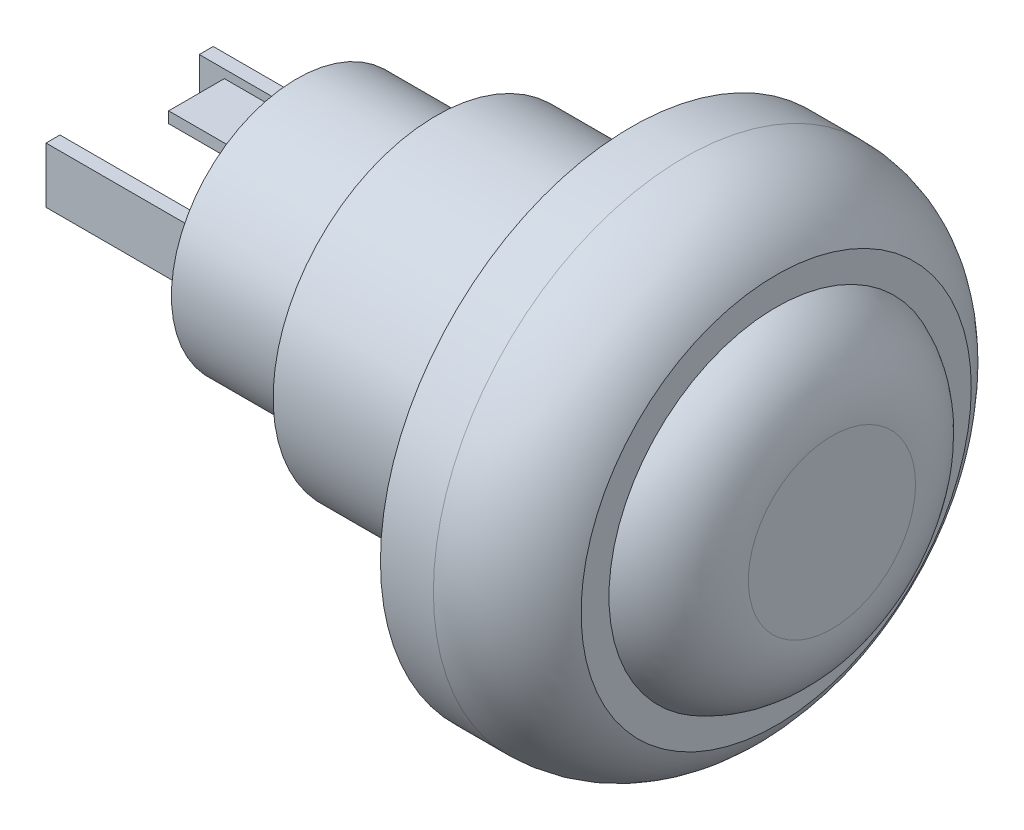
ISO-10303-21;
HEADER;
FILE_DESCRIPTION(('STEP AP214'),'2;1');
FILE_NAME('part.step','',(''),(''),'','','');
FILE_SCHEMA(('AUTOMOTIVE_DESIGN { 1 0 10303 214 1 1 1 1 }'));
ENDSEC;
DATA;
#1=APPLICATION_CONTEXT('core data for automotive mechanical design processes');
#2=APPLICATION_PROTOCOL_DEFINITION('international standard','automotive_design',2000,#1);
#3=PRODUCT_CONTEXT('',#1,'mechanical');
#4=PRODUCT('Part','Part','',(#3));
#5=PRODUCT_RELATED_PRODUCT_CATEGORY('part','',(#4));
#6=PRODUCT_DEFINITION_FORMATION('','',#4);
#7=PRODUCT_DEFINITION_CONTEXT('part definition',#1,'design');
#8=PRODUCT_DEFINITION('design','',#6,#7);
#9=PRODUCT_DEFINITION_SHAPE('','',#8);
#10=(LENGTH_UNIT() NAMED_UNIT(*) SI_UNIT(.MILLI.,.METRE.));
#11=(NAMED_UNIT(*) PLANE_ANGLE_UNIT() SI_UNIT($,.RADIAN.));
#12=(NAMED_UNIT(*) SI_UNIT($,.STERADIAN.) SOLID_ANGLE_UNIT());
#13=UNCERTAINTY_MEASURE_WITH_UNIT(LENGTH_MEASURE(1.E-05),#10,'distance_accuracy_value','');
#14=(GEOMETRIC_REPRESENTATION_CONTEXT(3) GLOBAL_UNCERTAINTY_ASSIGNED_CONTEXT((#13)) GLOBAL_UNIT_ASSIGNED_CONTEXT((#10,
#11,#12)) REPRESENTATION_CONTEXT('',''));
#15=CARTESIAN_POINT('',(0.,0.,0.));
#16=DIRECTION('',(0.,0.,1.));
#17=DIRECTION('',(1.,0.,0.));
#18=AXIS2_PLACEMENT_3D('',#15,#16,#17);
#19=CARTESIAN_POINT('',(11.,5.85,0.));
#20=DIRECTION('',(-1.,0.,0.));
#21=DIRECTION('',(0.,0.,1.));
#22=AXIS2_PLACEMENT_3D('',#19,#20,#21);
#23=PLANE('',#22);
#24=CARTESIAN_POINT('',(11.,0.,0.));
#25=DIRECTION('',(1.,0.,0.));
#26=DIRECTION('',(0.,0.,-1.));
#27=AXIS2_PLACEMENT_3D('',#24,#25,#26);
#28=CIRCLE('',#27,5.85);
#29=CARTESIAN_POINT('',(11.,0.,-5.85));
#30=VERTEX_POINT('',#29);
#31=EDGE_CURVE('E178',#30,#30,#28,.T.);
#32=ORIENTED_EDGE('',*,*,#31,.T.);
#33=EDGE_LOOP('',(#32));
#34=FACE_BOUND('',#33,.T.);
#35=CARTESIAN_POINT('',(11.,0.,0.));
#36=DIRECTION('',(1.,0.,0.));
#37=DIRECTION('',(0.,0.,-1.));
#38=AXIS2_PLACEMENT_3D('',#35,#36,#37);
#39=CIRCLE('',#38,6.75);
#40=CARTESIAN_POINT('',(11.,5.77593817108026,3.49299846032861));
#41=VERTEX_POINT('',#40);
#42=CARTESIAN_POINT('',(11.,5.99027306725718,-3.11112979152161));
#43=VERTEX_POINT('',#42);
#44=EDGE_CURVE('E175',#41,#43,#39,.T.);
#45=ORIENTED_EDGE('',*,*,#44,.F.);
#46=DIRECTION('',(0.,0.0324376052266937,-0.999473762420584));
#47=VECTOR('',#46,1.);
#48=CARTESIAN_POINT('',(11.,5.88926097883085,0.00127420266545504));
#49=LINE('',#48,#47);
#50=EDGE_CURVE('E166',#41,#43,#49,.T.);
#51=ORIENTED_EDGE('',*,*,#50,.T.);
#52=EDGE_LOOP('',(#45,#51));
#53=FACE_BOUND('',#52,.T.);
#54=ADVANCED_FACE('F38',(#34,#53),#23,.T.);
#55=CARTESIAN_POINT('',(0.,0.,0.));
#56=DIRECTION('',(1.,0.,0.));
#57=DIRECTION('',(0.,0.,-1.));
#58=AXIS2_PLACEMENT_3D('',#55,#56,#57);
#59=CYLINDRICAL_SURFACE('',#58,6.75);
#60=CARTESIAN_POINT('',(12.,0.,0.));
#61=DIRECTION('',(1.,0.,0.));
#62=DIRECTION('',(0.,0.,-1.));
#63=AXIS2_PLACEMENT_3D('',#60,#61,#62);
#64=CIRCLE('',#63,6.75);
#65=CARTESIAN_POINT('',(12.,5.77593817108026,3.49299846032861));
#66=VERTEX_POINT('',#65);
#67=CARTESIAN_POINT('',(12.,5.99027306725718,-3.11112979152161));
#68=VERTEX_POINT('',#67);
#69=EDGE_CURVE('E179',#66,#68,#64,.T.);
#70=ORIENTED_EDGE('',*,*,#69,.F.);
#71=DIRECTION('',(-1.,0.,0.));
#72=VECTOR('',#71,1.);
#73=CARTESIAN_POINT('',(18.6755753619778,5.77593817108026,3.49299846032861));
#74=LINE('',#73,#72);
#75=EDGE_CURVE('E171',#66,#41,#74,.T.);
#76=ORIENTED_EDGE('',*,*,#75,.T.);
#77=ORIENTED_EDGE('',*,*,#44,.T.);
#78=DIRECTION('',(-1.,0.,0.));
#79=VECTOR('',#78,1.);
#80=CARTESIAN_POINT('',(18.6755753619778,5.99027306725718,-3.11112979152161));
#81=LINE('',#80,#79);
#82=EDGE_CURVE('E163',#68,#43,#81,.T.);
#83=ORIENTED_EDGE('',*,*,#82,.F.);
#84=EDGE_LOOP('',(#70,#76,#77,#83));
#85=FACE_BOUND('',#84,.T.);
#86=ADVANCED_FACE('F177',(#85),#59,.T.);
#87=CARTESIAN_POINT('',(0.,0.,0.));
#88=DIRECTION('',(-1.,0.,0.));
#89=DIRECTION('',(0.,0.,1.));
#90=AXIS2_PLACEMENT_3D('',#87,#88,#89);
#91=PLANE('',#90);
#92=DIRECTION('',(0.,0.,1.));
#93=VECTOR('',#92,1.);
#94=CARTESIAN_POINT('',(0.,1.8,0.999999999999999));
#95=LINE('',#94,#93);
#96=CARTESIAN_POINT('',(0.,1.8,-1.));
#97=VERTEX_POINT('',#96);
#98=CARTESIAN_POINT('',(0.,1.8,0.999999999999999));
#99=VERTEX_POINT('',#98);
#100=EDGE_CURVE('E542',#97,#99,#95,.T.);
#101=ORIENTED_EDGE('',*,*,#100,.F.);
#102=DIRECTION('',(0.,-1.,0.));
#103=VECTOR('',#102,1.);
#104=CARTESIAN_POINT('',(0.,1.8,-1.));
#105=LINE('',#104,#103);
#106=CARTESIAN_POINT('',(0.,2.2,-1.));
#107=VERTEX_POINT('',#106);
#108=EDGE_CURVE('E538',#107,#97,#105,.T.);
#109=ORIENTED_EDGE('',*,*,#108,.F.);
#110=DIRECTION('',(0.,0.,-1.));
#111=VECTOR('',#110,1.);
#112=CARTESIAN_POINT('',(0.,2.2,0.999999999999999));
#113=LINE('',#112,#111);
#114=CARTESIAN_POINT('',(0.,2.2,0.999999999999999));
#115=VERTEX_POINT('',#114);
#116=EDGE_CURVE('E552',#115,#107,#113,.T.);
#117=ORIENTED_EDGE('',*,*,#116,.F.);
#118=DIRECTION('',(0.,1.,0.));
#119=VECTOR('',#118,1.);
#120=CARTESIAN_POINT('',(0.,1.8,0.999999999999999));
#121=LINE('',#120,#119);
#122=EDGE_CURVE('E560',#99,#115,#121,.T.);
#123=ORIENTED_EDGE('',*,*,#122,.F.);
#124=EDGE_LOOP('',(#101,#109,#117,#123));
#125=FACE_BOUND('',#124,.T.);
#126=DIRECTION('',(0.,0.,1.));
#127=VECTOR('',#126,1.);
#128=CARTESIAN_POINT('',(0.,-1.,-3.));
#129=LINE('',#128,#127);
#130=CARTESIAN_POINT('',(0.,-1.,-3.));
#131=VERTEX_POINT('',#130);
#132=CARTESIAN_POINT('',(0.,-1.,-2.5));
#133=VERTEX_POINT('',#132);
#134=EDGE_CURVE('E616',#131,#133,#129,.T.);
#135=ORIENTED_EDGE('',*,*,#134,.F.);
#136=DIRECTION('',(0.,-1.,0.));
#137=VECTOR('',#136,1.);
#138=CARTESIAN_POINT('',(0.,1.,-3.));
#139=LINE('',#138,#137);
#140=CARTESIAN_POINT('',(0.,1.,-3.));
#141=VERTEX_POINT('',#140);
#142=EDGE_CURVE('E602',#141,#131,#139,.T.);
#143=ORIENTED_EDGE('',*,*,#142,.F.);
#144=DIRECTION('',(0.,0.,-1.));
#145=VECTOR('',#144,1.);
#146=CARTESIAN_POINT('',(0.,1.,-3.));
#147=LINE('',#146,#145);
#148=CARTESIAN_POINT('',(0.,1.,-2.5));
#149=VERTEX_POINT('',#148);
#150=EDGE_CURVE('E607',#149,#141,#147,.T.);
#151=ORIENTED_EDGE('',*,*,#150,.F.);
#152=DIRECTION('',(0.,1.,0.));
#153=VECTOR('',#152,1.);
#154=CARTESIAN_POINT('',(0.,1.,-2.5));
#155=LINE('',#154,#153);
#156=EDGE_CURVE('E618',#133,#149,#155,.T.);
#157=ORIENTED_EDGE('',*,*,#156,.F.);
#158=EDGE_LOOP('',(#135,#143,#151,#157));
#159=FACE_BOUND('',#158,.T.);
#160=CARTESIAN_POINT('',(0.,0.,0.));
#161=DIRECTION('',(1.,0.,0.));
#162=DIRECTION('',(0.,0.,-1.));
#163=AXIS2_PLACEMENT_3D('',#160,#161,#162);
#164=CIRCLE('',#163,4.5);
#165=CARTESIAN_POINT('',(0.,0.,-4.5));
#166=VERTEX_POINT('',#165);
#167=EDGE_CURVE('E11',#166,#166,#164,.T.);
#168=ORIENTED_EDGE('',*,*,#167,.F.);
#169=EDGE_LOOP('',(#168));
#170=FACE_BOUND('',#169,.T.);
#171=DIRECTION('',(0.,0.,1.));
#172=VECTOR('',#171,1.);
#173=CARTESIAN_POINT('',(0.,-1.,2.5));
#174=LINE('',#173,#172);
#175=CARTESIAN_POINT('',(0.,-1.,2.5));
#176=VERTEX_POINT('',#175);
#177=CARTESIAN_POINT('',(0.,-1.,3.));
#178=VERTEX_POINT('',#177);
#179=EDGE_CURVE('E587',#176,#178,#174,.T.);
#180=ORIENTED_EDGE('',*,*,#179,.F.);
#181=DIRECTION('',(0.,-1.,0.));
#182=VECTOR('',#181,1.);
#183=CARTESIAN_POINT('',(0.,1.,2.5));
#184=LINE('',#183,#182);
#185=CARTESIAN_POINT('',(0.,1.,2.5));
#186=VERTEX_POINT('',#185);
#187=EDGE_CURVE('E573',#186,#176,#184,.T.);
#188=ORIENTED_EDGE('',*,*,#187,.F.);
#189=DIRECTION('',(0.,0.,-1.));
#190=VECTOR('',#189,1.);
#191=CARTESIAN_POINT('',(0.,1.,2.5));
#192=LINE('',#191,#190);
#193=CARTESIAN_POINT('',(0.,1.,3.));
#194=VERTEX_POINT('',#193);
#195=EDGE_CURVE('E578',#194,#186,#192,.T.);
#196=ORIENTED_EDGE('',*,*,#195,.F.);
#197=DIRECTION('',(0.,1.,0.));
#198=VECTOR('',#197,1.);
#199=CARTESIAN_POINT('',(0.,1.,3.));
#200=LINE('',#199,#198);
#201=EDGE_CURVE('E589',#178,#194,#200,.T.);
#202=ORIENTED_EDGE('',*,*,#201,.F.);
#203=EDGE_LOOP('',(#180,#188,#196,#202));
#204=FACE_BOUND('',#203,.T.);
#205=DIRECTION('',(0.,0.,-1.));
#206=VECTOR('',#205,1.);
#207=CARTESIAN_POINT('',(0.,-1.8,-0.999999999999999));
#208=LINE('',#207,#206);
#209=CARTESIAN_POINT('',(0.,-1.8,1.));
#210=VERTEX_POINT('',#209);
#211=CARTESIAN_POINT('',(0.,-1.8,-0.999999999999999));
#212=VERTEX_POINT('',#211);
#213=EDGE_CURVE('E672',#210,#212,#208,.T.);
#214=ORIENTED_EDGE('',*,*,#213,.F.);
#215=DIRECTION('',(0.,1.,0.));
#216=VECTOR('',#215,1.);
#217=CARTESIAN_POINT('',(0.,-1.8,1.));
#218=LINE('',#217,#216);
#219=CARTESIAN_POINT('',(0.,-2.2,1.));
#220=VERTEX_POINT('',#219);
#221=EDGE_CURVE('E536',#220,#210,#218,.T.);
#222=ORIENTED_EDGE('',*,*,#221,.F.);
#223=DIRECTION('',(0.,0.,1.));
#224=VECTOR('',#223,1.);
#225=CARTESIAN_POINT('',(0.,-2.2,-0.999999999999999));
#226=LINE('',#225,#224);
#227=CARTESIAN_POINT('',(0.,-2.2,-0.999999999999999));
#228=VERTEX_POINT('',#227);
#229=EDGE_CURVE('E531',#228,#220,#226,.T.);
#230=ORIENTED_EDGE('',*,*,#229,.F.);
#231=DIRECTION('',(0.,-1.,0.));
#232=VECTOR('',#231,1.);
#233=CARTESIAN_POINT('',(0.,-1.8,-0.999999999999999));
#234=LINE('',#233,#232);
#235=EDGE_CURVE('E674',#212,#228,#234,.T.);
#236=ORIENTED_EDGE('',*,*,#235,.F.);
#237=EDGE_LOOP('',(#214,#222,#230,#236));
#238=FACE_BOUND('',#237,.T.);
#239=ADVANCED_FACE('F40',(#125,#159,#170,#204,#238),#91,.T.);
#240=CARTESIAN_POINT('',(0.,0.,0.));
#241=DIRECTION('',(1.,0.,0.));
#242=DIRECTION('',(0.,0.,-1.));
#243=AXIS2_PLACEMENT_3D('',#240,#241,#242);
#244=CYLINDRICAL_SURFACE('',#243,4.5);
#245=ORIENTED_EDGE('',*,*,#167,.T.);
#246=EDGE_LOOP('',(#245));
#247=FACE_BOUND('',#246,.T.);
#248=CARTESIAN_POINT('',(5.,0.,0.));
#249=DIRECTION('',(1.,0.,0.));
#250=DIRECTION('',(0.,0.,-1.));
#251=AXIS2_PLACEMENT_3D('',#248,#249,#250);
#252=CIRCLE('',#251,4.5);
#253=CARTESIAN_POINT('',(5.,0.,-4.5));
#254=VERTEX_POINT('',#253);
#255=EDGE_CURVE('E46',#254,#254,#252,.T.);
#256=ORIENTED_EDGE('',*,*,#255,.F.);
#257=EDGE_LOOP('',(#256));
#258=FACE_BOUND('',#257,.T.);
#259=ADVANCED_FACE('F195',(#247,#258),#244,.T.);
#260=CARTESIAN_POINT('',(5.,4.5,0.));
#261=DIRECTION('',(-1.,0.,0.));
#262=DIRECTION('',(0.,0.,1.));
#263=AXIS2_PLACEMENT_3D('',#260,#261,#262);
#264=PLANE('',#263);
#265=ORIENTED_EDGE('',*,*,#255,.T.);
#266=EDGE_LOOP('',(#265));
#267=FACE_BOUND('',#266,.T.);
#268=CARTESIAN_POINT('',(5.,0.,0.));
#269=DIRECTION('',(1.,0.,0.));
#270=DIRECTION('',(0.,0.,-1.));
#271=AXIS2_PLACEMENT_3D('',#268,#269,#270);
#272=CIRCLE('',#271,5.85);
#273=CARTESIAN_POINT('',(5.,0.,-5.85));
#274=VERTEX_POINT('',#273);
#275=EDGE_CURVE('E182',#274,#274,#272,.T.);
#276=ORIENTED_EDGE('',*,*,#275,.F.);
#277=EDGE_LOOP('',(#276));
#278=FACE_BOUND('',#277,.T.);
#279=ADVANCED_FACE('F192',(#267,#278),#264,.T.);
#280=CARTESIAN_POINT('',(0.,0.,0.));
#281=DIRECTION('',(1.,0.,0.));
#282=DIRECTION('',(0.,0.,-1.));
#283=AXIS2_PLACEMENT_3D('',#280,#281,#282);
#284=CYLINDRICAL_SURFACE('',#283,5.85);
#285=ORIENTED_EDGE('',*,*,#275,.T.);
#286=EDGE_LOOP('',(#285));
#287=FACE_BOUND('',#286,.T.);
#288=ORIENTED_EDGE('',*,*,#31,.F.);
#289=EDGE_LOOP('',(#288));
#290=FACE_BOUND('',#289,.T.);
#291=ADVANCED_FACE('F202',(#287,#290),#284,.T.);
#292=CARTESIAN_POINT('',(12.,6.75,0.));
#293=DIRECTION('',(-1.,0.,0.));
#294=DIRECTION('',(0.,0.,1.));
#295=AXIS2_PLACEMENT_3D('',#292,#293,#294);
#296=PLANE('',#295);
#297=ORIENTED_EDGE('',*,*,#69,.T.);
#298=DIRECTION('',(0.,-0.0324376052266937,0.999473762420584));
#299=VECTOR('',#298,1.);
#300=CARTESIAN_POINT('',(12.,5.88926097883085,0.00127420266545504));
#301=LINE('',#300,#299);
#302=EDGE_CURVE('E52',#68,#66,#301,.T.);
#303=ORIENTED_EDGE('',*,*,#302,.T.);
#304=EDGE_LOOP('',(#297,#303));
#305=FACE_BOUND('',#304,.T.);
#306=CARTESIAN_POINT('',(12.,0.,0.));
#307=DIRECTION('',(1.,0.,0.));
#308=DIRECTION('',(0.,0.,-1.));
#309=AXIS2_PLACEMENT_3D('',#306,#307,#308);
#310=CIRCLE('',#309,9.);
#311=CARTESIAN_POINT('',(12.,0.,-9.));
#312=VERTEX_POINT('',#311);
#313=EDGE_CURVE('E184',#312,#312,#310,.T.);
#314=ORIENTED_EDGE('',*,*,#313,.F.);
#315=EDGE_LOOP('',(#314));
#316=FACE_BOUND('',#315,.T.);
#317=ADVANCED_FACE('F215',(#305,#316),#296,.T.);
#318=CARTESIAN_POINT('',(0.,0.,0.));
#319=DIRECTION('',(1.,0.,0.));
#320=DIRECTION('',(0.,0.,-1.));
#321=AXIS2_PLACEMENT_3D('',#318,#319,#320);
#322=CYLINDRICAL_SURFACE('',#321,9.);
#323=ORIENTED_EDGE('',*,*,#313,.T.);
#324=EDGE_LOOP('',(#323));
#325=FACE_BOUND('',#324,.T.);
#326=CARTESIAN_POINT('',(13.9,0.,0.));
#327=DIRECTION('',(1.,0.,0.));
#328=DIRECTION('',(0.,0.,-1.));
#329=AXIS2_PLACEMENT_3D('',#326,#327,#328);
#330=CIRCLE('',#329,9.);
#331=CARTESIAN_POINT('',(13.9,0.,-9.));
#332=VERTEX_POINT('',#331);
#333=EDGE_CURVE('E640',#332,#332,#330,.T.);
#334=ORIENTED_EDGE('',*,*,#333,.F.);
#335=EDGE_LOOP('',(#334));
#336=FACE_BOUND('',#335,.T.);
#337=ADVANCED_FACE('F220',(#325,#336),#322,.T.);
#338=CARTESIAN_POINT('',(13.9,0.,0.));
#339=DIRECTION('',(1.,0.,0.));
#340=DIRECTION('',(0.,0.,-1.));
#341=AXIS2_PLACEMENT_3D('',#338,#339,#340);
#342=TOROIDAL_SURFACE('',#341,5.2775,3.7225);
#343=ORIENTED_EDGE('',*,*,#333,.T.);
#344=EDGE_LOOP('',(#343));
#345=FACE_BOUND('',#344,.T.);
#346=CARTESIAN_POINT('',(17.2,0.,0.));
#347=DIRECTION('',(1.,0.,0.));
#348=DIRECTION('',(0.,0.,-1.));
#349=AXIS2_PLACEMENT_3D('',#346,#347,#348);
#350=CIRCLE('',#349,7.);
#351=CARTESIAN_POINT('',(17.2,0.,-7.));
#352=VERTEX_POINT('',#351);
#353=EDGE_CURVE('E637',#352,#352,#350,.T.);
#354=ORIENTED_EDGE('',*,*,#353,.F.);
#355=EDGE_LOOP('',(#354));
#356=FACE_BOUND('',#355,.T.);
#357=ADVANCED_FACE('F227',(#345,#356),#342,.T.);
#358=CARTESIAN_POINT('',(17.2,7.,0.));
#359=DIRECTION('',(1.,0.,0.));
#360=DIRECTION('',(0.,0.,-1.));
#361=AXIS2_PLACEMENT_3D('',#358,#359,#360);
#362=PLANE('',#361);
#363=ORIENTED_EDGE('',*,*,#353,.T.);
#364=EDGE_LOOP('',(#363));
#365=FACE_BOUND('',#364,.T.);
#366=CARTESIAN_POINT('',(17.2,0.,0.));
#367=DIRECTION('',(1.,0.,0.));
#368=DIRECTION('',(0.,0.,-1.));
#369=AXIS2_PLACEMENT_3D('',#366,#367,#368);
#370=CIRCLE('',#369,6.);
#371=CARTESIAN_POINT('',(17.2,0.,-6.));
#372=VERTEX_POINT('',#371);
#373=EDGE_CURVE('E634',#372,#372,#370,.T.);
#374=ORIENTED_EDGE('',*,*,#373,.F.);
#375=EDGE_LOOP('',(#374));
#376=FACE_BOUND('',#375,.T.);
#377=ADVANCED_FACE('F234',(#365,#376),#362,.T.);
#378=CARTESIAN_POINT('',(16.0470949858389,0.,0.));
#379=DIRECTION('',(1.,0.,0.));
#380=DIRECTION('',(0.,0.,-1.));
#381=AXIS2_PLACEMENT_3D('',#378,#379,#380);
#382=DEGENERATE_TOROIDAL_SURFACE('',#381,3.06472999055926,3.15356940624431,.T.);
#383=ORIENTED_EDGE('',*,*,#373,.T.);
#384=EDGE_LOOP('',(#383));
#385=FACE_BOUND('',#384,.T.);
#386=CARTESIAN_POINT('',(19.2,0.,0.));
#387=DIRECTION('',(1.,0.,0.));
#388=DIRECTION('',(0.,0.,-1.));
#389=AXIS2_PLACEMENT_3D('',#386,#387,#388);
#390=CIRCLE('',#389,3.);
#391=CARTESIAN_POINT('',(19.2,0.,-3.));
#392=VERTEX_POINT('',#391);
#393=EDGE_CURVE('E631',#392,#392,#390,.T.);
#394=ORIENTED_EDGE('',*,*,#393,.F.);
#395=EDGE_LOOP('',(#394));
#396=FACE_BOUND('',#395,.T.);
#397=ADVANCED_FACE('F238',(#385,#396),#382,.T.);
#398=CARTESIAN_POINT('',(19.2,3.,0.));
#399=DIRECTION('',(1.,0.,0.));
#400=DIRECTION('',(0.,0.,-1.));
#401=AXIS2_PLACEMENT_3D('',#398,#399,#400);
#402=PLANE('',#401);
#403=ORIENTED_EDGE('',*,*,#393,.T.);
#404=EDGE_LOOP('',(#403));
#405=FACE_BOUND('',#404,.T.);
#406=ADVANCED_FACE('F242',(#405),#402,.T.);
#407=CARTESIAN_POINT('',(-6.,1.,-3.));
#408=DIRECTION('',(0.,0.,1.));
#409=DIRECTION('',(1.,0.,0.));
#410=AXIS2_PLACEMENT_3D('',#407,#408,#409);
#411=PLANE('',#410);
#412=ORIENTED_EDGE('',*,*,#142,.T.);
#413=DIRECTION('',(1.,0.,0.));
#414=VECTOR('',#413,1.);
#415=CARTESIAN_POINT('',(-6.,-1.,-3.));
#416=LINE('',#415,#414);
#417=CARTESIAN_POINT('',(-6.,-1.,-3.));
#418=VERTEX_POINT('',#417);
#419=EDGE_CURVE('E629',#418,#131,#416,.T.);
#420=ORIENTED_EDGE('',*,*,#419,.F.);
#421=DIRECTION('',(0.,-1.,0.));
#422=VECTOR('',#421,1.);
#423=CARTESIAN_POINT('',(-6.,1.,-3.));
#424=LINE('',#423,#422);
#425=CARTESIAN_POINT('',(-6.,1.,-3.));
#426=VERTEX_POINT('',#425);
#427=EDGE_CURVE('E603',#426,#418,#424,.T.);
#428=ORIENTED_EDGE('',*,*,#427,.F.);
#429=DIRECTION('',(1.,0.,0.));
#430=VECTOR('',#429,1.);
#431=CARTESIAN_POINT('',(-6.,1.,-3.));
#432=LINE('',#431,#430);
#433=EDGE_CURVE('E613',#426,#141,#432,.T.);
#434=ORIENTED_EDGE('',*,*,#433,.T.);
#435=EDGE_LOOP('',(#412,#420,#428,#434));
#436=FACE_BOUND('',#435,.T.);
#437=ADVANCED_FACE('F246',(#436),#411,.F.);
#438=CARTESIAN_POINT('',(-6.,-1.,-3.));
#439=DIRECTION('',(0.,1.,0.));
#440=DIRECTION('',(0.,0.,1.));
#441=AXIS2_PLACEMENT_3D('',#438,#439,#440);
#442=PLANE('',#441);
#443=ORIENTED_EDGE('',*,*,#134,.T.);
#444=DIRECTION('',(1.,0.,0.));
#445=VECTOR('',#444,1.);
#446=CARTESIAN_POINT('',(-6.,-1.,-2.5));
#447=LINE('',#446,#445);
#448=CARTESIAN_POINT('',(-6.,-1.,-2.5));
#449=VERTEX_POINT('',#448);
#450=EDGE_CURVE('E626',#449,#133,#447,.T.);
#451=ORIENTED_EDGE('',*,*,#450,.F.);
#452=DIRECTION('',(0.,0.,1.));
#453=VECTOR('',#452,1.);
#454=CARTESIAN_POINT('',(-6.,-1.,-3.));
#455=LINE('',#454,#453);
#456=EDGE_CURVE('E606',#418,#449,#455,.T.);
#457=ORIENTED_EDGE('',*,*,#456,.F.);
#458=ORIENTED_EDGE('',*,*,#419,.T.);
#459=EDGE_LOOP('',(#443,#451,#457,#458));
#460=FACE_BOUND('',#459,.T.);
#461=ADVANCED_FACE('F250',(#460),#442,.F.);
#462=CARTESIAN_POINT('',(-6.,1.,-2.5));
#463=DIRECTION('',(0.,0.,-1.));
#464=DIRECTION('',(-1.,0.,0.));
#465=AXIS2_PLACEMENT_3D('',#462,#463,#464);
#466=PLANE('',#465);
#467=ORIENTED_EDGE('',*,*,#156,.T.);
#468=DIRECTION('',(1.,0.,0.));
#469=VECTOR('',#468,1.);
#470=CARTESIAN_POINT('',(-6.,1.,-2.5));
#471=LINE('',#470,#469);
#472=CARTESIAN_POINT('',(-6.,1.,-2.5));
#473=VERTEX_POINT('',#472);
#474=EDGE_CURVE('E624',#473,#149,#471,.T.);
#475=ORIENTED_EDGE('',*,*,#474,.F.);
#476=DIRECTION('',(0.,1.,0.));
#477=VECTOR('',#476,1.);
#478=CARTESIAN_POINT('',(-6.,1.,-2.5));
#479=LINE('',#478,#477);
#480=EDGE_CURVE('E609',#449,#473,#479,.T.);
#481=ORIENTED_EDGE('',*,*,#480,.F.);
#482=ORIENTED_EDGE('',*,*,#450,.T.);
#483=EDGE_LOOP('',(#467,#475,#481,#482));
#484=FACE_BOUND('',#483,.T.);
#485=ADVANCED_FACE('F254',(#484),#466,.F.);
#486=CARTESIAN_POINT('',(-6.,1.,-3.));
#487=DIRECTION('',(0.,-1.,0.));
#488=DIRECTION('',(0.,0.,-1.));
#489=AXIS2_PLACEMENT_3D('',#486,#487,#488);
#490=PLANE('',#489);
#491=ORIENTED_EDGE('',*,*,#150,.T.);
#492=ORIENTED_EDGE('',*,*,#433,.F.);
#493=DIRECTION('',(0.,0.,-1.));
#494=VECTOR('',#493,1.);
#495=CARTESIAN_POINT('',(-6.,1.,-3.));
#496=LINE('',#495,#494);
#497=EDGE_CURVE('E611',#473,#426,#496,.T.);
#498=ORIENTED_EDGE('',*,*,#497,.F.);
#499=ORIENTED_EDGE('',*,*,#474,.T.);
#500=EDGE_LOOP('',(#491,#492,#498,#499));
#501=FACE_BOUND('',#500,.T.);
#502=ADVANCED_FACE('F258',(#501),#490,.F.);
#503=CARTESIAN_POINT('',(-6.,-1.,-3.));
#504=DIRECTION('',(-1.,0.,0.));
#505=DIRECTION('',(0.,0.,1.));
#506=AXIS2_PLACEMENT_3D('',#503,#504,#505);
#507=PLANE('',#506);
#508=ORIENTED_EDGE('',*,*,#427,.T.);
#509=ORIENTED_EDGE('',*,*,#456,.T.);
#510=ORIENTED_EDGE('',*,*,#480,.T.);
#511=ORIENTED_EDGE('',*,*,#497,.T.);
#512=EDGE_LOOP('',(#508,#509,#510,#511));
#513=FACE_BOUND('',#512,.T.);
#514=ADVANCED_FACE('F262',(#513),#507,.T.);
#515=CARTESIAN_POINT('',(-6.,1.,2.5));
#516=DIRECTION('',(0.,0.,1.));
#517=DIRECTION('',(1.,0.,0.));
#518=AXIS2_PLACEMENT_3D('',#515,#516,#517);
#519=PLANE('',#518);
#520=ORIENTED_EDGE('',*,*,#187,.T.);
#521=DIRECTION('',(1.,0.,0.));
#522=VECTOR('',#521,1.);
#523=CARTESIAN_POINT('',(-6.,-1.,2.5));
#524=LINE('',#523,#522);
#525=CARTESIAN_POINT('',(-6.,-1.,2.5));
#526=VERTEX_POINT('',#525);
#527=EDGE_CURVE('E600',#526,#176,#524,.T.);
#528=ORIENTED_EDGE('',*,*,#527,.F.);
#529=DIRECTION('',(0.,-1.,0.));
#530=VECTOR('',#529,1.);
#531=CARTESIAN_POINT('',(-6.,1.,2.5));
#532=LINE('',#531,#530);
#533=CARTESIAN_POINT('',(-6.,1.,2.5));
#534=VERTEX_POINT('',#533);
#535=EDGE_CURVE('E574',#534,#526,#532,.T.);
#536=ORIENTED_EDGE('',*,*,#535,.F.);
#537=DIRECTION('',(1.,0.,0.));
#538=VECTOR('',#537,1.);
#539=CARTESIAN_POINT('',(-6.,1.,2.5));
#540=LINE('',#539,#538);
#541=EDGE_CURVE('E584',#534,#186,#540,.T.);
#542=ORIENTED_EDGE('',*,*,#541,.T.);
#543=EDGE_LOOP('',(#520,#528,#536,#542));
#544=FACE_BOUND('',#543,.T.);
#545=ADVANCED_FACE('F266',(#544),#519,.F.);
#546=CARTESIAN_POINT('',(-6.,-1.,2.5));
#547=DIRECTION('',(0.,1.,0.));
#548=DIRECTION('',(0.,0.,1.));
#549=AXIS2_PLACEMENT_3D('',#546,#547,#548);
#550=PLANE('',#549);
#551=ORIENTED_EDGE('',*,*,#179,.T.);
#552=DIRECTION('',(1.,0.,0.));
#553=VECTOR('',#552,1.);
#554=CARTESIAN_POINT('',(-6.,-1.,3.));
#555=LINE('',#554,#553);
#556=CARTESIAN_POINT('',(-6.,-1.,3.));
#557=VERTEX_POINT('',#556);
#558=EDGE_CURVE('E597',#557,#178,#555,.T.);
#559=ORIENTED_EDGE('',*,*,#558,.F.);
#560=DIRECTION('',(0.,0.,1.));
#561=VECTOR('',#560,1.);
#562=CARTESIAN_POINT('',(-6.,-1.,2.5));
#563=LINE('',#562,#561);
#564=EDGE_CURVE('E577',#526,#557,#563,.T.);
#565=ORIENTED_EDGE('',*,*,#564,.F.);
#566=ORIENTED_EDGE('',*,*,#527,.T.);
#567=EDGE_LOOP('',(#551,#559,#565,#566));
#568=FACE_BOUND('',#567,.T.);
#569=ADVANCED_FACE('F270',(#568),#550,.F.);
#570=CARTESIAN_POINT('',(-6.,1.,3.));
#571=DIRECTION('',(0.,0.,-1.));
#572=DIRECTION('',(-1.,0.,0.));
#573=AXIS2_PLACEMENT_3D('',#570,#571,#572);
#574=PLANE('',#573);
#575=ORIENTED_EDGE('',*,*,#201,.T.);
#576=DIRECTION('',(1.,0.,0.));
#577=VECTOR('',#576,1.);
#578=CARTESIAN_POINT('',(-6.,1.,3.));
#579=LINE('',#578,#577);
#580=CARTESIAN_POINT('',(-6.,1.,3.));
#581=VERTEX_POINT('',#580);
#582=EDGE_CURVE('E595',#581,#194,#579,.T.);
#583=ORIENTED_EDGE('',*,*,#582,.F.);
#584=DIRECTION('',(0.,1.,0.));
#585=VECTOR('',#584,1.);
#586=CARTESIAN_POINT('',(-6.,1.,3.));
#587=LINE('',#586,#585);
#588=EDGE_CURVE('E580',#557,#581,#587,.T.);
#589=ORIENTED_EDGE('',*,*,#588,.F.);
#590=ORIENTED_EDGE('',*,*,#558,.T.);
#591=EDGE_LOOP('',(#575,#583,#589,#590));
#592=FACE_BOUND('',#591,.T.);
#593=ADVANCED_FACE('F274',(#592),#574,.F.);
#594=CARTESIAN_POINT('',(-6.,1.,2.5));
#595=DIRECTION('',(0.,-1.,0.));
#596=DIRECTION('',(0.,0.,-1.));
#597=AXIS2_PLACEMENT_3D('',#594,#595,#596);
#598=PLANE('',#597);
#599=ORIENTED_EDGE('',*,*,#195,.T.);
#600=ORIENTED_EDGE('',*,*,#541,.F.);
#601=DIRECTION('',(0.,0.,-1.));
#602=VECTOR('',#601,1.);
#603=CARTESIAN_POINT('',(-6.,1.,2.5));
#604=LINE('',#603,#602);
#605=EDGE_CURVE('E582',#581,#534,#604,.T.);
#606=ORIENTED_EDGE('',*,*,#605,.F.);
#607=ORIENTED_EDGE('',*,*,#582,.T.);
#608=EDGE_LOOP('',(#599,#600,#606,#607));
#609=FACE_BOUND('',#608,.T.);
#610=ADVANCED_FACE('F278',(#609),#598,.F.);
#611=CARTESIAN_POINT('',(-6.,-1.,2.5));
#612=DIRECTION('',(-1.,0.,0.));
#613=DIRECTION('',(0.,0.,1.));
#614=AXIS2_PLACEMENT_3D('',#611,#612,#613);
#615=PLANE('',#614);
#616=ORIENTED_EDGE('',*,*,#535,.T.);
#617=ORIENTED_EDGE('',*,*,#564,.T.);
#618=ORIENTED_EDGE('',*,*,#588,.T.);
#619=ORIENTED_EDGE('',*,*,#605,.T.);
#620=EDGE_LOOP('',(#616,#617,#618,#619));
#621=FACE_BOUND('',#620,.T.);
#622=ADVANCED_FACE('F282',(#621),#615,.T.);
#623=CARTESIAN_POINT('',(-3.6,1.8,-1.));
#624=DIRECTION('',(0.,0.,1.));
#625=DIRECTION('',(0.,-1.,0.));
#626=AXIS2_PLACEMENT_3D('',#623,#624,#625);
#627=PLANE('',#626);
#628=ORIENTED_EDGE('',*,*,#108,.T.);
#629=DIRECTION('',(1.,0.,0.));
#630=VECTOR('',#629,1.);
#631=CARTESIAN_POINT('',(-3.6,1.8,-1.));
#632=LINE('',#631,#630);
#633=CARTESIAN_POINT('',(-3.6,1.8,-1.));
#634=VERTEX_POINT('',#633);
#635=EDGE_CURVE('E571',#634,#97,#632,.T.);
#636=ORIENTED_EDGE('',*,*,#635,.F.);
#637=DIRECTION('',(0.,-1.,0.));
#638=VECTOR('',#637,1.);
#639=CARTESIAN_POINT('',(-3.6,1.8,-1.));
#640=LINE('',#639,#638);
#641=CARTESIAN_POINT('',(-3.6,2.2,-1.));
#642=VERTEX_POINT('',#641);
#643=EDGE_CURVE('E548',#642,#634,#640,.T.);
#644=ORIENTED_EDGE('',*,*,#643,.F.);
#645=DIRECTION('',(1.,0.,0.));
#646=VECTOR('',#645,1.);
#647=CARTESIAN_POINT('',(-3.6,2.2,-1.));
#648=LINE('',#647,#646);
#649=EDGE_CURVE('E557',#642,#107,#648,.T.);
#650=ORIENTED_EDGE('',*,*,#649,.T.);
#651=EDGE_LOOP('',(#628,#636,#644,#650));
#652=FACE_BOUND('',#651,.T.);
#653=ADVANCED_FACE('F286',(#652),#627,.F.);
#654=CARTESIAN_POINT('',(-3.6,1.8,0.999999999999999));
#655=DIRECTION('',(0.,1.,0.));
#656=DIRECTION('',(0.,0.,1.));
#657=AXIS2_PLACEMENT_3D('',#654,#655,#656);
#658=PLANE('',#657);
#659=ORIENTED_EDGE('',*,*,#100,.T.);
#660=DIRECTION('',(1.,0.,0.));
#661=VECTOR('',#660,1.);
#662=CARTESIAN_POINT('',(-3.6,1.8,0.999999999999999));
#663=LINE('',#662,#661);
#664=CARTESIAN_POINT('',(-3.6,1.8,0.999999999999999));
#665=VERTEX_POINT('',#664);
#666=EDGE_CURVE('E568',#665,#99,#663,.T.);
#667=ORIENTED_EDGE('',*,*,#666,.F.);
#668=DIRECTION('',(0.,0.,1.));
#669=VECTOR('',#668,1.);
#670=CARTESIAN_POINT('',(-3.6,1.8,0.999999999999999));
#671=LINE('',#670,#669);
#672=EDGE_CURVE('E551',#634,#665,#671,.T.);
#673=ORIENTED_EDGE('',*,*,#672,.F.);
#674=ORIENTED_EDGE('',*,*,#635,.T.);
#675=EDGE_LOOP('',(#659,#667,#673,#674));
#676=FACE_BOUND('',#675,.T.);
#677=ADVANCED_FACE('F290',(#676),#658,.F.);
#678=CARTESIAN_POINT('',(-3.6,1.8,0.999999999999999));
#679=DIRECTION('',(0.,0.,-1.));
#680=DIRECTION('',(0.,1.,0.));
#681=AXIS2_PLACEMENT_3D('',#678,#679,#680);
#682=PLANE('',#681);
#683=ORIENTED_EDGE('',*,*,#122,.T.);
#684=DIRECTION('',(1.,0.,0.));
#685=VECTOR('',#684,1.);
#686=CARTESIAN_POINT('',(-3.6,2.2,0.999999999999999));
#687=LINE('',#686,#685);
#688=CARTESIAN_POINT('',(-3.6,2.2,0.999999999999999));
#689=VERTEX_POINT('',#688);
#690=EDGE_CURVE('E566',#689,#115,#687,.T.);
#691=ORIENTED_EDGE('',*,*,#690,.F.);
#692=DIRECTION('',(0.,1.,0.));
#693=VECTOR('',#692,1.);
#694=CARTESIAN_POINT('',(-3.6,1.8,0.999999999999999));
#695=LINE('',#694,#693);
#696=EDGE_CURVE('E554',#665,#689,#695,.T.);
#697=ORIENTED_EDGE('',*,*,#696,.F.);
#698=ORIENTED_EDGE('',*,*,#666,.T.);
#699=EDGE_LOOP('',(#683,#691,#697,#698));
#700=FACE_BOUND('',#699,.T.);
#701=ADVANCED_FACE('F294',(#700),#682,.F.);
#702=CARTESIAN_POINT('',(-3.6,2.2,0.999999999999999));
#703=DIRECTION('',(0.,-1.,0.));
#704=DIRECTION('',(0.,0.,-1.));
#705=AXIS2_PLACEMENT_3D('',#702,#703,#704);
#706=PLANE('',#705);
#707=ORIENTED_EDGE('',*,*,#116,.T.);
#708=ORIENTED_EDGE('',*,*,#649,.F.);
#709=DIRECTION('',(0.,0.,-1.));
#710=VECTOR('',#709,1.);
#711=CARTESIAN_POINT('',(-3.6,2.2,0.999999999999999));
#712=LINE('',#711,#710);
#713=EDGE_CURVE('E556',#689,#642,#712,.T.);
#714=ORIENTED_EDGE('',*,*,#713,.F.);
#715=ORIENTED_EDGE('',*,*,#690,.T.);
#716=EDGE_LOOP('',(#707,#708,#714,#715));
#717=FACE_BOUND('',#716,.T.);
#718=ADVANCED_FACE('F298',(#717),#706,.F.);
#719=CARTESIAN_POINT('',(-3.6,0.,0.));
#720=DIRECTION('',(-1.,0.,0.));
#721=DIRECTION('',(0.,0.,1.));
#722=AXIS2_PLACEMENT_3D('',#719,#720,#721);
#723=PLANE('',#722);
#724=ORIENTED_EDGE('',*,*,#643,.T.);
#725=ORIENTED_EDGE('',*,*,#672,.T.);
#726=ORIENTED_EDGE('',*,*,#696,.T.);
#727=ORIENTED_EDGE('',*,*,#713,.T.);
#728=EDGE_LOOP('',(#724,#725,#726,#727));
#729=FACE_BOUND('',#728,.T.);
#730=ADVANCED_FACE('F302',(#729),#723,.T.);
#731=CARTESIAN_POINT('',(-3.6,-1.8,1.));
#732=DIRECTION('',(0.,0.,-1.));
#733=DIRECTION('',(0.,1.,0.));
#734=AXIS2_PLACEMENT_3D('',#731,#732,#733);
#735=PLANE('',#734);
#736=ORIENTED_EDGE('',*,*,#221,.T.);
#737=DIRECTION('',(1.,0.,0.));
#738=VECTOR('',#737,1.);
#739=CARTESIAN_POINT('',(-3.6,-1.8,1.));
#740=LINE('',#739,#738);
#741=CARTESIAN_POINT('',(-3.6,-1.8,1.));
#742=VERTEX_POINT('',#741);
#743=EDGE_CURVE('E534',#742,#210,#740,.T.);
#744=ORIENTED_EDGE('',*,*,#743,.F.);
#745=DIRECTION('',(0.,1.,0.));
#746=VECTOR('',#745,1.);
#747=CARTESIAN_POINT('',(-3.6,-1.8,1.));
#748=LINE('',#747,#746);
#749=CARTESIAN_POINT('',(-3.6,-2.2,1.));
#750=VERTEX_POINT('',#749);
#751=EDGE_CURVE('E524',#750,#742,#748,.T.);
#752=ORIENTED_EDGE('',*,*,#751,.F.);
#753=DIRECTION('',(1.,0.,0.));
#754=VECTOR('',#753,1.);
#755=CARTESIAN_POINT('',(-3.6,-2.2,1.));
#756=LINE('',#755,#754);
#757=EDGE_CURVE('E681',#750,#220,#756,.T.);
#758=ORIENTED_EDGE('',*,*,#757,.T.);
#759=EDGE_LOOP('',(#736,#744,#752,#758));
#760=FACE_BOUND('',#759,.T.);
#761=ADVANCED_FACE('F306',(#760),#735,.F.);
#762=CARTESIAN_POINT('',(-3.6,-1.8,-0.999999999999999));
#763=DIRECTION('',(0.,-1.,0.));
#764=DIRECTION('',(0.,0.,-1.));
#765=AXIS2_PLACEMENT_3D('',#762,#763,#764);
#766=PLANE('',#765);
#767=ORIENTED_EDGE('',*,*,#213,.T.);
#768=DIRECTION('',(1.,0.,0.));
#769=VECTOR('',#768,1.);
#770=CARTESIAN_POINT('',(-3.6,-1.8,-0.999999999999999));
#771=LINE('',#770,#769);
#772=CARTESIAN_POINT('',(-3.6,-1.8,-0.999999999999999));
#773=VERTEX_POINT('',#772);
#774=EDGE_CURVE('E539',#773,#212,#771,.T.);
#775=ORIENTED_EDGE('',*,*,#774,.F.);
#776=DIRECTION('',(0.,0.,-1.));
#777=VECTOR('',#776,1.);
#778=CARTESIAN_POINT('',(-3.6,-1.8,-0.999999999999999));
#779=LINE('',#778,#777);
#780=EDGE_CURVE('E526',#742,#773,#779,.T.);
#781=ORIENTED_EDGE('',*,*,#780,.F.);
#782=ORIENTED_EDGE('',*,*,#743,.T.);
#783=EDGE_LOOP('',(#767,#775,#781,#782));
#784=FACE_BOUND('',#783,.T.);
#785=ADVANCED_FACE('F310',(#784),#766,.F.);
#786=CARTESIAN_POINT('',(-3.6,-1.8,-0.999999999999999));
#787=DIRECTION('',(0.,0.,1.));
#788=DIRECTION('',(0.,-1.,0.));
#789=AXIS2_PLACEMENT_3D('',#786,#787,#788);
#790=PLANE('',#789);
#791=ORIENTED_EDGE('',*,*,#235,.T.);
#792=DIRECTION('',(1.,0.,0.));
#793=VECTOR('',#792,1.);
#794=CARTESIAN_POINT('',(-3.6,-2.2,-0.999999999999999));
#795=LINE('',#794,#793);
#796=CARTESIAN_POINT('',(-3.6,-2.2,-0.999999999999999));
#797=VERTEX_POINT('',#796);
#798=EDGE_CURVE('E60',#797,#228,#795,.T.);
#799=ORIENTED_EDGE('',*,*,#798,.F.);
#800=DIRECTION('',(0.,-1.,0.));
#801=VECTOR('',#800,1.);
#802=CARTESIAN_POINT('',(-3.6,-1.8,-0.999999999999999));
#803=LINE('',#802,#801);
#804=EDGE_CURVE('E682',#773,#797,#803,.T.);
#805=ORIENTED_EDGE('',*,*,#804,.F.);
#806=ORIENTED_EDGE('',*,*,#774,.T.);
#807=EDGE_LOOP('',(#791,#799,#805,#806));
#808=FACE_BOUND('',#807,.T.);
#809=ADVANCED_FACE('F314',(#808),#790,.F.);
#810=CARTESIAN_POINT('',(-3.6,-2.2,-0.999999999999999));
#811=DIRECTION('',(0.,1.,0.));
#812=DIRECTION('',(0.,0.,1.));
#813=AXIS2_PLACEMENT_3D('',#810,#811,#812);
#814=PLANE('',#813);
#815=ORIENTED_EDGE('',*,*,#229,.T.);
#816=ORIENTED_EDGE('',*,*,#757,.F.);
#817=DIRECTION('',(0.,0.,1.));
#818=VECTOR('',#817,1.);
#819=CARTESIAN_POINT('',(-3.6,-2.2,-0.999999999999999));
#820=LINE('',#819,#818);
#821=EDGE_CURVE('E528',#797,#750,#820,.T.);
#822=ORIENTED_EDGE('',*,*,#821,.F.);
#823=ORIENTED_EDGE('',*,*,#798,.T.);
#824=EDGE_LOOP('',(#815,#816,#822,#823));
#825=FACE_BOUND('',#824,.T.);
#826=ADVANCED_FACE('F318',(#825),#814,.F.);
#827=CARTESIAN_POINT('',(-3.6,0.,0.));
#828=DIRECTION('',(-1.,0.,0.));
#829=DIRECTION('',(0.,0.,1.));
#830=AXIS2_PLACEMENT_3D('',#827,#828,#829);
#831=PLANE('',#830);
#832=ORIENTED_EDGE('',*,*,#751,.T.);
#833=ORIENTED_EDGE('',*,*,#780,.T.);
#834=ORIENTED_EDGE('',*,*,#804,.T.);
#835=ORIENTED_EDGE('',*,*,#821,.T.);
#836=EDGE_LOOP('',(#832,#833,#834,#835));
#837=FACE_BOUND('',#836,.T.);
#838=ADVANCED_FACE('F322',(#837),#831,.T.);
#839=CARTESIAN_POINT('',(18.6755753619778,5.88926097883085,0.00127420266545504));
#840=DIRECTION('',(0.,0.999473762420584,0.0324376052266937));
#841=DIRECTION('',(0.,-0.0324376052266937,0.999473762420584));
#842=AXIS2_PLACEMENT_3D('',#839,#840,#841);
#843=PLANE('',#842);
#844=ORIENTED_EDGE('',*,*,#82,.T.);
#845=ORIENTED_EDGE('',*,*,#50,.F.);
#846=ORIENTED_EDGE('',*,*,#75,.F.);
#847=ORIENTED_EDGE('',*,*,#302,.F.);
#848=EDGE_LOOP('',(#844,#845,#846,#847));
#849=FACE_BOUND('',#848,.T.);
#850=ADVANCED_FACE('F165',(#849),#843,.T.);
#851=CLOSED_SHELL('',(#54,#86,#239,#259,#279,#291,#317,#337,#357,#377,#397,#406,#437,#461,#485,
#502,#514,#545,#569,#593,#610,#622,#653,#677,#701,#718,#730,#761,#785,#809,#826,#838,#850));
#852=MANIFOLD_SOLID_BREP('B2',#851);
#853=ADVANCED_BREP_SHAPE_REPRESENTATION('',(#18,#852),#14);
#854=SHAPE_DEFINITION_REPRESENTATION(#9,#853);
ENDSEC;
END-ISO-10303-21;
